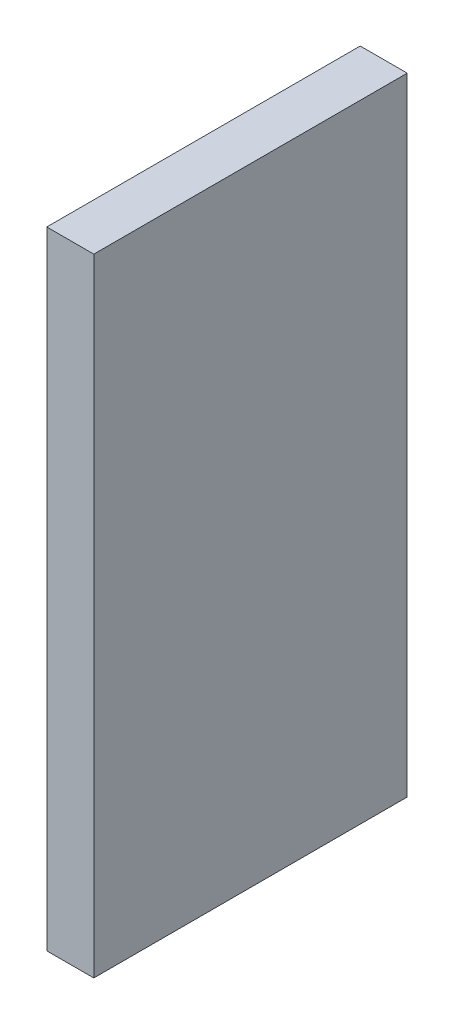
from build123d import *

# Parameters (mm, degrees)
SKETCH1_W      = 1.5
SKETCH1_H      = 20
EXTRUDE1_DEPTH = 10


with BuildPart() as part:
    # Sketch1 → Extrude1 (new body)
    with BuildSketch(Plane.XY):
        with Locations((15.271696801, -42.266063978)):
            Rectangle(SKETCH1_W, SKETCH1_H)
    extrude(amount=-EXTRUDE1_DEPTH)


solid = part.part
